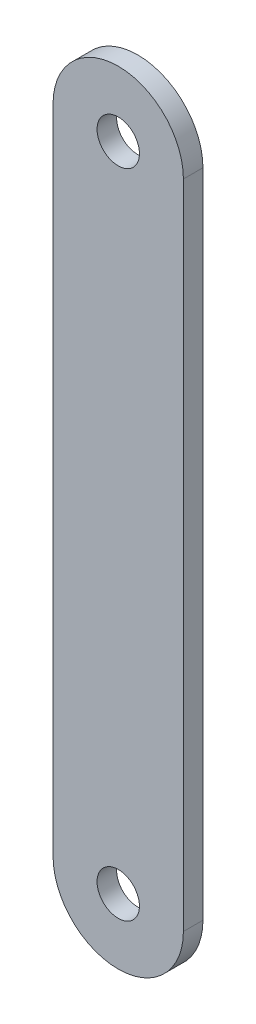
from build123d import *

# Parameters (mm, degrees)
SKETCH1_R      = 3.25
EXTRUDE1_DEPTH = 3


with BuildPart() as part:
    # Sketch1 → Extrude1 (new body)
    with BuildSketch(Plane.XY):
        with BuildLine():
            Line((10, 0), (10, 100))
            ThreePointArc((10, 100), (0, 110), (-10, 100))
            Line((-10, 100), (-10, 0))
            ThreePointArc((-10, 0), (0, -10), (10, 0))
        make_face()
        with Locations((0, 100)):
            Circle(SKETCH1_R, mode=Mode.SUBTRACT)
        Circle(SKETCH1_R, mode=Mode.SUBTRACT)
    extrude(amount=EXTRUDE1_DEPTH)


solid = part.part
